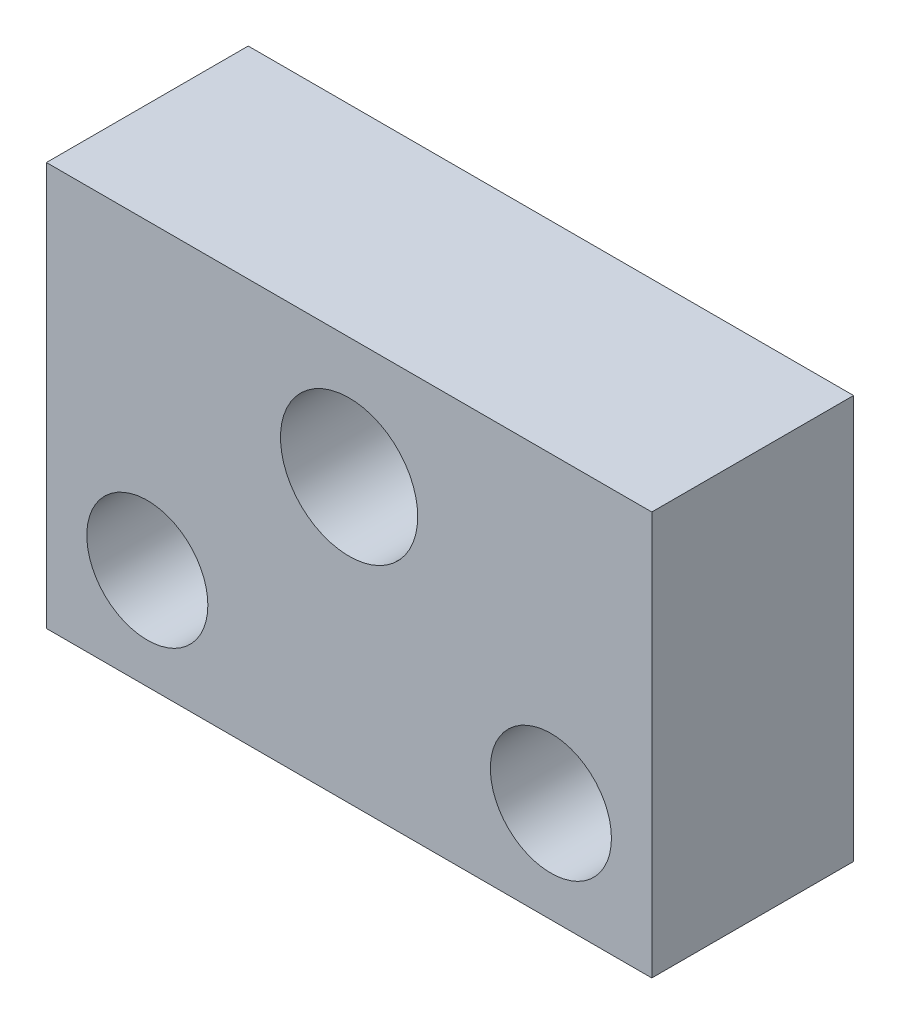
ISO-10303-21;
HEADER;
FILE_DESCRIPTION(('STEP AP214'),'2;1');
FILE_NAME('part.step','',(''),(''),'','','');
FILE_SCHEMA(('AUTOMOTIVE_DESIGN { 1 0 10303 214 1 1 1 1 }'));
ENDSEC;
DATA;
#1=APPLICATION_CONTEXT('core data for automotive mechanical design processes');
#2=APPLICATION_PROTOCOL_DEFINITION('international standard','automotive_design',2000,#1);
#3=PRODUCT_CONTEXT('',#1,'mechanical');
#4=PRODUCT('Part','Part','',(#3));
#5=PRODUCT_RELATED_PRODUCT_CATEGORY('part','',(#4));
#6=PRODUCT_DEFINITION_FORMATION('','',#4);
#7=PRODUCT_DEFINITION_CONTEXT('part definition',#1,'design');
#8=PRODUCT_DEFINITION('design','',#6,#7);
#9=PRODUCT_DEFINITION_SHAPE('','',#8);
#10=(LENGTH_UNIT() NAMED_UNIT(*) SI_UNIT(.MILLI.,.METRE.));
#11=(NAMED_UNIT(*) PLANE_ANGLE_UNIT() SI_UNIT($,.RADIAN.));
#12=(NAMED_UNIT(*) SI_UNIT($,.STERADIAN.) SOLID_ANGLE_UNIT());
#13=UNCERTAINTY_MEASURE_WITH_UNIT(LENGTH_MEASURE(1.E-05),#10,'distance_accuracy_value','');
#14=(GEOMETRIC_REPRESENTATION_CONTEXT(3) GLOBAL_UNCERTAINTY_ASSIGNED_CONTEXT((#13)) GLOBAL_UNIT_ASSIGNED_CONTEXT((#10,
#11,#12)) REPRESENTATION_CONTEXT('',''));
#15=CARTESIAN_POINT('',(0.,0.,0.));
#16=DIRECTION('',(0.,0.,1.));
#17=DIRECTION('',(1.,0.,0.));
#18=AXIS2_PLACEMENT_3D('',#15,#16,#17);
#19=CARTESIAN_POINT('',(0.,0.,10.));
#20=DIRECTION('',(0.,0.,-1.));
#21=DIRECTION('',(-1.,0.,0.));
#22=AXIS2_PLACEMENT_3D('',#19,#20,#21);
#23=PLANE('',#22);
#24=CARTESIAN_POINT('',(0.,4.,10.));
#25=DIRECTION('',(0.,0.,1.));
#26=DIRECTION('',(1.,0.,0.));
#27=AXIS2_PLACEMENT_3D('',#24,#25,#26);
#28=CIRCLE('',#27,3.4);
#29=CARTESIAN_POINT('',(3.4,4.,10.));
#30=VERTEX_POINT('',#29);
#31=EDGE_CURVE('E139',#30,#30,#28,.T.);
#32=ORIENTED_EDGE('',*,*,#31,.F.);
#33=EDGE_LOOP('',(#32));
#34=FACE_BOUND('',#33,.T.);
#35=DIRECTION('',(0.,-1.,0.));
#36=VECTOR('',#35,1.);
#37=CARTESIAN_POINT('',(-15.,10.,10.));
#38=LINE('',#37,#36);
#39=CARTESIAN_POINT('',(-15.,10.,10.));
#40=VERTEX_POINT('',#39);
#41=CARTESIAN_POINT('',(-15.,-10.,10.));
#42=VERTEX_POINT('',#41);
#43=EDGE_CURVE('E98',#40,#42,#38,.T.);
#44=ORIENTED_EDGE('',*,*,#43,.T.);
#45=DIRECTION('',(1.,0.,0.));
#46=VECTOR('',#45,1.);
#47=CARTESIAN_POINT('',(15.,-10.,10.));
#48=LINE('',#47,#46);
#49=CARTESIAN_POINT('',(15.,-10.,10.));
#50=VERTEX_POINT('',#49);
#51=EDGE_CURVE('E93',#42,#50,#48,.T.);
#52=ORIENTED_EDGE('',*,*,#51,.T.);
#53=DIRECTION('',(0.,1.,0.));
#54=VECTOR('',#53,1.);
#55=CARTESIAN_POINT('',(15.,10.,10.));
#56=LINE('',#55,#54);
#57=CARTESIAN_POINT('',(15.,10.,10.));
#58=VERTEX_POINT('',#57);
#59=EDGE_CURVE('E96',#50,#58,#56,.T.);
#60=ORIENTED_EDGE('',*,*,#59,.T.);
#61=DIRECTION('',(-1.,0.,0.));
#62=VECTOR('',#61,1.);
#63=CARTESIAN_POINT('',(15.,10.,10.));
#64=LINE('',#63,#62);
#65=EDGE_CURVE('E63',#58,#40,#64,.T.);
#66=ORIENTED_EDGE('',*,*,#65,.T.);
#67=EDGE_LOOP('',(#44,#52,#60,#66));
#68=FACE_BOUND('',#67,.T.);
#69=CARTESIAN_POINT('',(-10.,-5.,10.));
#70=DIRECTION('',(0.,0.,1.));
#71=DIRECTION('',(1.,0.,0.));
#72=AXIS2_PLACEMENT_3D('',#69,#70,#71);
#73=CIRCLE('',#72,3.);
#74=CARTESIAN_POINT('',(-7.,-5.,10.));
#75=VERTEX_POINT('',#74);
#76=EDGE_CURVE('E113',#75,#75,#73,.T.);
#77=ORIENTED_EDGE('',*,*,#76,.F.);
#78=EDGE_LOOP('',(#77));
#79=FACE_BOUND('',#78,.T.);
#80=CARTESIAN_POINT('',(10.,-5.,10.));
#81=DIRECTION('',(0.,0.,1.));
#82=DIRECTION('',(1.,0.,0.));
#83=AXIS2_PLACEMENT_3D('',#80,#81,#82);
#84=CIRCLE('',#83,3.);
#85=CARTESIAN_POINT('',(13.,-5.,10.));
#86=VERTEX_POINT('',#85);
#87=EDGE_CURVE('E128',#86,#86,#84,.T.);
#88=ORIENTED_EDGE('',*,*,#87,.F.);
#89=EDGE_LOOP('',(#88));
#90=FACE_BOUND('',#89,.T.);
#91=ADVANCED_FACE('F46',(#34,#68,#79,#90),#23,.F.);
#92=CARTESIAN_POINT('',(0.,0.,0.));
#93=DIRECTION('',(0.,0.,-1.));
#94=DIRECTION('',(-1.,0.,0.));
#95=AXIS2_PLACEMENT_3D('',#92,#93,#94);
#96=PLANE('',#95);
#97=CARTESIAN_POINT('',(0.,4.,0.));
#98=DIRECTION('',(0.,0.,1.));
#99=DIRECTION('',(1.,0.,0.));
#100=AXIS2_PLACEMENT_3D('',#97,#98,#99);
#101=CIRCLE('',#100,3.4);
#102=CARTESIAN_POINT('',(3.4,4.,0.));
#103=VERTEX_POINT('',#102);
#104=EDGE_CURVE('E134',#103,#103,#101,.T.);
#105=ORIENTED_EDGE('',*,*,#104,.T.);
#106=EDGE_LOOP('',(#105));
#107=FACE_BOUND('',#106,.T.);
#108=CARTESIAN_POINT('',(-10.,-5.,0.));
#109=DIRECTION('',(0.,0.,1.));
#110=DIRECTION('',(1.,0.,0.));
#111=AXIS2_PLACEMENT_3D('',#108,#109,#110);
#112=CIRCLE('',#111,3.);
#113=CARTESIAN_POINT('',(-7.,-5.,0.));
#114=VERTEX_POINT('',#113);
#115=EDGE_CURVE('E125',#114,#114,#112,.T.);
#116=ORIENTED_EDGE('',*,*,#115,.T.);
#117=EDGE_LOOP('',(#116));
#118=FACE_BOUND('',#117,.T.);
#119=DIRECTION('',(0.,-1.,0.));
#120=VECTOR('',#119,1.);
#121=CARTESIAN_POINT('',(-15.,10.,0.));
#122=LINE('',#121,#120);
#123=CARTESIAN_POINT('',(-15.,10.,0.));
#124=VERTEX_POINT('',#123);
#125=CARTESIAN_POINT('',(-15.,-10.,0.));
#126=VERTEX_POINT('',#125);
#127=EDGE_CURVE('E110',#124,#126,#122,.T.);
#128=ORIENTED_EDGE('',*,*,#127,.F.);
#129=DIRECTION('',(-1.,0.,0.));
#130=VECTOR('',#129,1.);
#131=CARTESIAN_POINT('',(15.,10.,0.));
#132=LINE('',#131,#130);
#133=CARTESIAN_POINT('',(15.,10.,0.));
#134=VERTEX_POINT('',#133);
#135=EDGE_CURVE('E86',#134,#124,#132,.T.);
#136=ORIENTED_EDGE('',*,*,#135,.F.);
#137=DIRECTION('',(0.,1.,0.));
#138=VECTOR('',#137,1.);
#139=CARTESIAN_POINT('',(15.,10.,0.));
#140=LINE('',#139,#138);
#141=CARTESIAN_POINT('',(15.,-10.,0.));
#142=VERTEX_POINT('',#141);
#143=EDGE_CURVE('E80',#142,#134,#140,.T.);
#144=ORIENTED_EDGE('',*,*,#143,.F.);
#145=DIRECTION('',(1.,0.,0.));
#146=VECTOR('',#145,1.);
#147=CARTESIAN_POINT('',(15.,-10.,0.));
#148=LINE('',#147,#146);
#149=EDGE_CURVE('E102',#126,#142,#148,.T.);
#150=ORIENTED_EDGE('',*,*,#149,.F.);
#151=EDGE_LOOP('',(#128,#136,#144,#150));
#152=FACE_BOUND('',#151,.T.);
#153=CARTESIAN_POINT('',(10.,-5.,0.));
#154=DIRECTION('',(0.,0.,1.));
#155=DIRECTION('',(1.,0.,0.));
#156=AXIS2_PLACEMENT_3D('',#153,#154,#155);
#157=CIRCLE('',#156,3.);
#158=CARTESIAN_POINT('',(13.,-5.,0.));
#159=VERTEX_POINT('',#158);
#160=EDGE_CURVE('E131',#159,#159,#157,.T.);
#161=ORIENTED_EDGE('',*,*,#160,.T.);
#162=EDGE_LOOP('',(#161));
#163=FACE_BOUND('',#162,.T.);
#164=ADVANCED_FACE('F121',(#107,#118,#152,#163),#96,.T.);
#165=CARTESIAN_POINT('',(-15.,10.,10.));
#166=DIRECTION('',(1.,0.,0.));
#167=DIRECTION('',(0.,1.,0.));
#168=AXIS2_PLACEMENT_3D('',#165,#166,#167);
#169=PLANE('',#168);
#170=ORIENTED_EDGE('',*,*,#127,.T.);
#171=DIRECTION('',(0.,0.,-1.));
#172=VECTOR('',#171,1.);
#173=CARTESIAN_POINT('',(-15.,-10.,10.));
#174=LINE('',#173,#172);
#175=EDGE_CURVE('E13',#42,#126,#174,.T.);
#176=ORIENTED_EDGE('',*,*,#175,.F.);
#177=ORIENTED_EDGE('',*,*,#43,.F.);
#178=DIRECTION('',(0.,0.,-1.));
#179=VECTOR('',#178,1.);
#180=CARTESIAN_POINT('',(-15.,10.,10.));
#181=LINE('',#180,#179);
#182=EDGE_CURVE('E106',#40,#124,#181,.T.);
#183=ORIENTED_EDGE('',*,*,#182,.T.);
#184=EDGE_LOOP('',(#170,#176,#177,#183));
#185=FACE_BOUND('',#184,.T.);
#186=ADVANCED_FACE('F48',(#185),#169,.F.);
#187=CARTESIAN_POINT('',(15.,-10.,10.));
#188=DIRECTION('',(0.,1.,0.));
#189=DIRECTION('',(-1.,0.,0.));
#190=AXIS2_PLACEMENT_3D('',#187,#188,#189);
#191=PLANE('',#190);
#192=ORIENTED_EDGE('',*,*,#149,.T.);
#193=DIRECTION('',(0.,0.,-1.));
#194=VECTOR('',#193,1.);
#195=CARTESIAN_POINT('',(15.,-10.,10.));
#196=LINE('',#195,#194);
#197=EDGE_CURVE('E55',#50,#142,#196,.T.);
#198=ORIENTED_EDGE('',*,*,#197,.F.);
#199=ORIENTED_EDGE('',*,*,#51,.F.);
#200=ORIENTED_EDGE('',*,*,#175,.T.);
#201=EDGE_LOOP('',(#192,#198,#199,#200));
#202=FACE_BOUND('',#201,.T.);
#203=ADVANCED_FACE('F101',(#202),#191,.F.);
#204=CARTESIAN_POINT('',(15.,10.,10.));
#205=DIRECTION('',(-1.,0.,0.));
#206=DIRECTION('',(0.,-1.,0.));
#207=AXIS2_PLACEMENT_3D('',#204,#205,#206);
#208=PLANE('',#207);
#209=ORIENTED_EDGE('',*,*,#143,.T.);
#210=DIRECTION('',(0.,0.,-1.));
#211=VECTOR('',#210,1.);
#212=CARTESIAN_POINT('',(15.,10.,10.));
#213=LINE('',#212,#211);
#214=EDGE_CURVE('E103',#58,#134,#213,.T.);
#215=ORIENTED_EDGE('',*,*,#214,.F.);
#216=ORIENTED_EDGE('',*,*,#59,.F.);
#217=ORIENTED_EDGE('',*,*,#197,.T.);
#218=EDGE_LOOP('',(#209,#215,#216,#217));
#219=FACE_BOUND('',#218,.T.);
#220=ADVANCED_FACE('F104',(#219),#208,.F.);
#221=CARTESIAN_POINT('',(15.,10.,10.));
#222=DIRECTION('',(0.,-1.,0.));
#223=DIRECTION('',(1.,0.,0.));
#224=AXIS2_PLACEMENT_3D('',#221,#222,#223);
#225=PLANE('',#224);
#226=ORIENTED_EDGE('',*,*,#135,.T.);
#227=ORIENTED_EDGE('',*,*,#182,.F.);
#228=ORIENTED_EDGE('',*,*,#65,.F.);
#229=ORIENTED_EDGE('',*,*,#214,.T.);
#230=EDGE_LOOP('',(#226,#227,#228,#229));
#231=FACE_BOUND('',#230,.T.);
#232=ADVANCED_FACE('F118',(#231),#225,.F.);
#233=CARTESIAN_POINT('',(-10.,-5.,10.));
#234=DIRECTION('',(0.,0.,-1.));
#235=DIRECTION('',(-1.,0.,0.));
#236=AXIS2_PLACEMENT_3D('',#233,#234,#235);
#237=CYLINDRICAL_SURFACE('',#236,3.);
#238=ORIENTED_EDGE('',*,*,#76,.T.);
#239=EDGE_LOOP('',(#238));
#240=FACE_BOUND('',#239,.T.);
#241=ORIENTED_EDGE('',*,*,#115,.F.);
#242=EDGE_LOOP('',(#241));
#243=FACE_BOUND('',#242,.T.);
#244=ADVANCED_FACE('F153',(#240,#243),#237,.F.);
#245=CARTESIAN_POINT('',(10.,-5.,10.));
#246=DIRECTION('',(0.,0.,-1.));
#247=DIRECTION('',(-1.,0.,0.));
#248=AXIS2_PLACEMENT_3D('',#245,#246,#247);
#249=CYLINDRICAL_SURFACE('',#248,3.);
#250=ORIENTED_EDGE('',*,*,#87,.T.);
#251=EDGE_LOOP('',(#250));
#252=FACE_BOUND('',#251,.T.);
#253=ORIENTED_EDGE('',*,*,#160,.F.);
#254=EDGE_LOOP('',(#253));
#255=FACE_BOUND('',#254,.T.);
#256=ADVANCED_FACE('F181',(#252,#255),#249,.F.);
#257=CARTESIAN_POINT('',(0.,4.,10.));
#258=DIRECTION('',(0.,0.,1.));
#259=DIRECTION('',(1.,0.,0.));
#260=AXIS2_PLACEMENT_3D('',#257,#258,#259);
#261=CYLINDRICAL_SURFACE('',#260,3.4);
#262=ORIENTED_EDGE('',*,*,#104,.F.);
#263=EDGE_LOOP('',(#262));
#264=FACE_BOUND('',#263,.T.);
#265=ORIENTED_EDGE('',*,*,#31,.T.);
#266=EDGE_LOOP('',(#265));
#267=FACE_BOUND('',#266,.T.);
#268=ADVANCED_FACE('F143',(#264,#267),#261,.F.);
#269=CLOSED_SHELL('',(#91,#164,#186,#203,#220,#232,#244,#256,#268));
#270=MANIFOLD_SOLID_BREP('B2',#269);
#271=ADVANCED_BREP_SHAPE_REPRESENTATION('',(#18,#270),#14);
#272=SHAPE_DEFINITION_REPRESENTATION(#9,#271);
ENDSEC;
END-ISO-10303-21;
